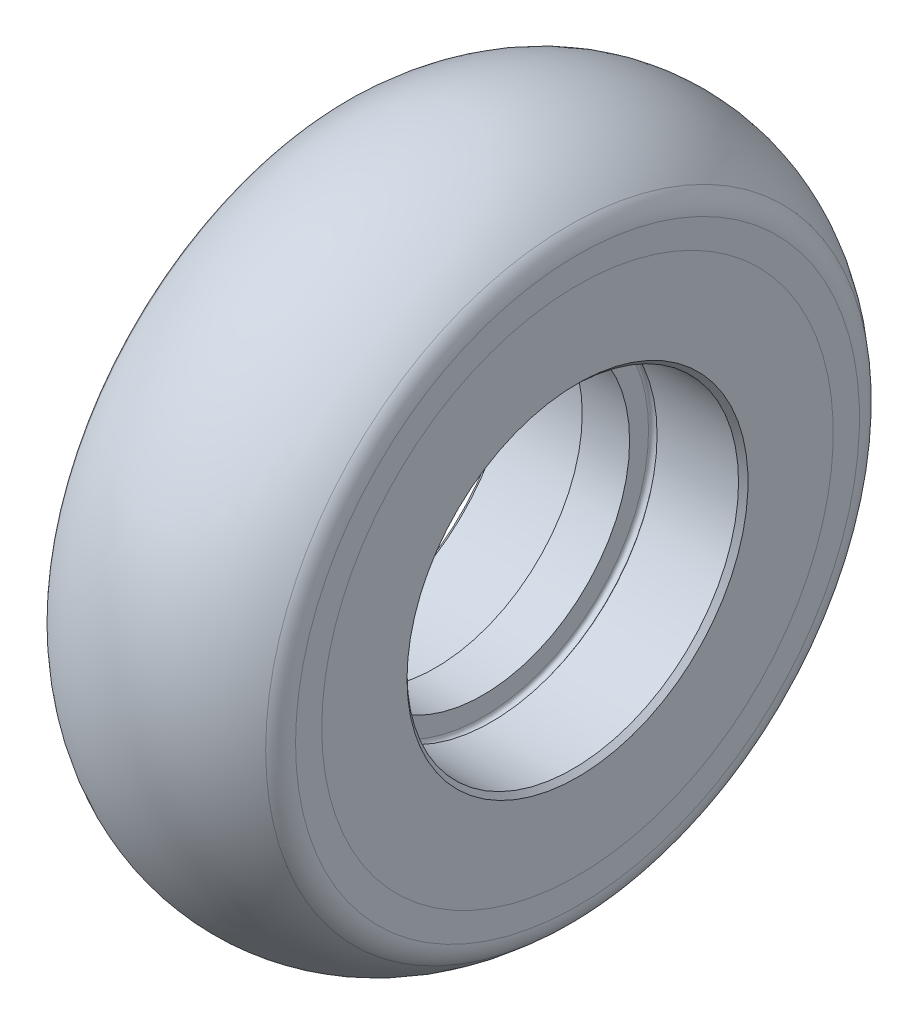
ISO-10303-21;
HEADER;
FILE_DESCRIPTION(('STEP AP214'),'2;1');
FILE_NAME('part.step','',(''),(''),'','','');
FILE_SCHEMA(('AUTOMOTIVE_DESIGN { 1 0 10303 214 1 1 1 1 }'));
ENDSEC;
DATA;
#1=APPLICATION_CONTEXT('core data for automotive mechanical design processes');
#2=APPLICATION_PROTOCOL_DEFINITION('international standard','automotive_design',2000,#1);
#3=PRODUCT_CONTEXT('',#1,'mechanical');
#4=PRODUCT('Part','Part','',(#3));
#5=PRODUCT_RELATED_PRODUCT_CATEGORY('part','',(#4));
#6=PRODUCT_DEFINITION_FORMATION('','',#4);
#7=PRODUCT_DEFINITION_CONTEXT('part definition',#1,'design');
#8=PRODUCT_DEFINITION('design','',#6,#7);
#9=PRODUCT_DEFINITION_SHAPE('','',#8);
#10=(LENGTH_UNIT() NAMED_UNIT(*) SI_UNIT(.MILLI.,.METRE.));
#11=(NAMED_UNIT(*) PLANE_ANGLE_UNIT() SI_UNIT($,.RADIAN.));
#12=(NAMED_UNIT(*) SI_UNIT($,.STERADIAN.) SOLID_ANGLE_UNIT());
#13=UNCERTAINTY_MEASURE_WITH_UNIT(LENGTH_MEASURE(1.E-05),#10,'distance_accuracy_value','');
#14=(GEOMETRIC_REPRESENTATION_CONTEXT(3) GLOBAL_UNCERTAINTY_ASSIGNED_CONTEXT((#13)) GLOBAL_UNIT_ASSIGNED_CONTEXT((#10,
#11,#12)) REPRESENTATION_CONTEXT('',''));
#15=CARTESIAN_POINT('',(0.,0.,0.));
#16=DIRECTION('',(0.,0.,1.));
#17=DIRECTION('',(1.,0.,0.));
#18=AXIS2_PLACEMENT_3D('',#15,#16,#17);
#19=CARTESIAN_POINT('',(-16.4076040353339,0.,0.));
#20=DIRECTION('',(-1.,0.,0.));
#21=DIRECTION('',(0.,0.,1.));
#22=AXIS2_PLACEMENT_3D('',#19,#20,#21);
#23=CYLINDRICAL_SURFACE('',#22,27.4999999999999);
#24=CARTESIAN_POINT('',(-8.43674989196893,0.,0.));
#25=DIRECTION('',(-1.,0.,0.));
#26=DIRECTION('',(0.,0.,1.));
#27=AXIS2_PLACEMENT_3D('',#24,#25,#26);
#28=CIRCLE('',#27,27.4999999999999);
#29=CARTESIAN_POINT('',(-8.43674989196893,0.,27.4999999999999));
#30=VERTEX_POINT('',#29);
#31=EDGE_CURVE('E11',#30,#30,#28,.T.);
#32=ORIENTED_EDGE('',*,*,#31,.F.);
#33=EDGE_LOOP('',(#32));
#34=FACE_BOUND('',#33,.T.);
#35=CARTESIAN_POINT('',(-11.9999999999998,0.,0.));
#36=DIRECTION('',(-1.,0.,0.));
#37=DIRECTION('',(0.,0.,1.));
#38=AXIS2_PLACEMENT_3D('',#35,#36,#37);
#39=CIRCLE('',#38,27.4999999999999);
#40=CARTESIAN_POINT('',(-11.9999999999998,0.,27.4999999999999));
#41=VERTEX_POINT('',#40);
#42=EDGE_CURVE('E97',#41,#41,#39,.T.);
#43=ORIENTED_EDGE('',*,*,#42,.T.);
#44=EDGE_LOOP('',(#43));
#45=FACE_BOUND('',#44,.T.);
#46=ADVANCED_FACE('F45',(#34,#45),#23,.F.);
#47=CARTESIAN_POINT('',(-8.43674989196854,0.,0.));
#48=DIRECTION('',(-1.,0.,0.));
#49=DIRECTION('',(0.,0.,1.));
#50=AXIS2_PLACEMENT_3D('',#47,#48,#49);
#51=TOROIDAL_SURFACE('',#50,29.4999999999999,2.);
#52=CARTESIAN_POINT('',(-6.90030733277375,0.,0.));
#53=DIRECTION('',(-1.,0.,0.));
#54=DIRECTION('',(0.,0.,1.));
#55=AXIS2_PLACEMENT_3D('',#52,#53,#54);
#56=CIRCLE('',#55,28.219631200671);
#57=CARTESIAN_POINT('',(-6.90030733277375,0.,28.219631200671));
#58=VERTEX_POINT('',#57);
#59=EDGE_CURVE('E51',#58,#58,#56,.T.);
#60=ORIENTED_EDGE('',*,*,#59,.F.);
#61=EDGE_LOOP('',(#60));
#62=FACE_BOUND('',#61,.T.);
#63=ORIENTED_EDGE('',*,*,#31,.T.);
#64=EDGE_LOOP('',(#63));
#65=FACE_BOUND('',#64,.T.);
#66=ADVANCED_FACE('F182',(#62,#65),#51,.T.);
#67=CARTESIAN_POINT('',(-6.90030733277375,0.,0.));
#68=DIRECTION('',(1.,0.,0.));
#69=DIRECTION('',(0.,0.,-1.));
#70=AXIS2_PLACEMENT_3D('',#67,#68,#69);
#71=CONICAL_SURFACE('',#70,28.219631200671,0.876058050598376);
#72=CARTESIAN_POINT('',(-5.59969266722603,0.,0.));
#73=DIRECTION('',(-1.,0.,0.));
#74=DIRECTION('',(0.,0.,1.));
#75=AXIS2_PLACEMENT_3D('',#72,#73,#74);
#76=CIRCLE('',#75,29.7803687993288);
#77=CARTESIAN_POINT('',(-5.59969266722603,0.,29.7803687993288));
#78=VERTEX_POINT('',#77);
#79=EDGE_CURVE('E55',#78,#78,#76,.T.);
#80=ORIENTED_EDGE('',*,*,#79,.F.);
#81=EDGE_LOOP('',(#80));
#82=FACE_BOUND('',#81,.T.);
#83=ORIENTED_EDGE('',*,*,#59,.T.);
#84=EDGE_LOOP('',(#83));
#85=FACE_BOUND('',#84,.T.);
#86=ADVANCED_FACE('F177',(#82,#85),#71,.F.);
#87=CARTESIAN_POINT('',(-4.06325010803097,0.,0.));
#88=DIRECTION('',(-1.,0.,0.));
#89=DIRECTION('',(0.,0.,1.));
#90=AXIS2_PLACEMENT_3D('',#87,#88,#89);
#91=TOROIDAL_SURFACE('',#90,28.5000000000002,2.);
#92=CARTESIAN_POINT('',(-4.06325010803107,0.,0.));
#93=DIRECTION('',(-1.,0.,0.));
#94=DIRECTION('',(0.,0.,1.));
#95=AXIS2_PLACEMENT_3D('',#92,#93,#94);
#96=CIRCLE('',#95,30.5000000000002);
#97=CARTESIAN_POINT('',(-4.06325010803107,0.,30.5000000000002));
#98=VERTEX_POINT('',#97);
#99=EDGE_CURVE('E59',#98,#98,#96,.T.);
#100=ORIENTED_EDGE('',*,*,#99,.F.);
#101=EDGE_LOOP('',(#100));
#102=FACE_BOUND('',#101,.T.);
#103=ORIENTED_EDGE('',*,*,#79,.T.);
#104=EDGE_LOOP('',(#103));
#105=FACE_BOUND('',#104,.T.);
#106=ADVANCED_FACE('F171',(#102,#105),#91,.F.);
#107=CARTESIAN_POINT('',(-16.4076040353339,0.,0.));
#108=DIRECTION('',(-1.,0.,0.));
#109=DIRECTION('',(0.,0.,1.));
#110=AXIS2_PLACEMENT_3D('',#107,#108,#109);
#111=CYLINDRICAL_SURFACE('',#110,30.5000000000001);
#112=CARTESIAN_POINT('',(4.06325010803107,0.,0.));
#113=DIRECTION('',(-1.,0.,0.));
#114=DIRECTION('',(0.,0.,1.));
#115=AXIS2_PLACEMENT_3D('',#112,#113,#114);
#116=CIRCLE('',#115,30.4999999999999);
#117=CARTESIAN_POINT('',(4.06325010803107,0.,30.4999999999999));
#118=VERTEX_POINT('',#117);
#119=EDGE_CURVE('E64',#118,#118,#116,.T.);
#120=ORIENTED_EDGE('',*,*,#119,.F.);
#121=EDGE_LOOP('',(#120));
#122=FACE_BOUND('',#121,.T.);
#123=ORIENTED_EDGE('',*,*,#99,.T.);
#124=EDGE_LOOP('',(#123));
#125=FACE_BOUND('',#124,.T.);
#126=ADVANCED_FACE('F165',(#122,#125),#111,.F.);
#127=CARTESIAN_POINT('',(4.06325010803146,0.,0.));
#128=DIRECTION('',(-1.,0.,0.));
#129=DIRECTION('',(0.,0.,1.));
#130=AXIS2_PLACEMENT_3D('',#127,#128,#129);
#131=TOROIDAL_SURFACE('',#130,28.4999999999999,2.);
#132=CARTESIAN_POINT('',(5.59969266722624,0.,0.));
#133=DIRECTION('',(-1.,0.,0.));
#134=DIRECTION('',(0.,0.,1.));
#135=AXIS2_PLACEMENT_3D('',#132,#133,#134);
#136=CIRCLE('',#135,29.7803687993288);
#137=CARTESIAN_POINT('',(5.59969266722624,0.,29.7803687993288));
#138=VERTEX_POINT('',#137);
#139=EDGE_CURVE('E67',#138,#138,#136,.T.);
#140=ORIENTED_EDGE('',*,*,#139,.F.);
#141=EDGE_LOOP('',(#140));
#142=FACE_BOUND('',#141,.T.);
#143=ORIENTED_EDGE('',*,*,#119,.T.);
#144=EDGE_LOOP('',(#143));
#145=FACE_BOUND('',#144,.T.);
#146=ADVANCED_FACE('F159',(#142,#145),#131,.F.);
#147=CARTESIAN_POINT('',(5.59969266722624,0.,0.));
#148=DIRECTION('',(-1.,0.,0.));
#149=DIRECTION('',(0.,0.,1.));
#150=AXIS2_PLACEMENT_3D('',#147,#148,#149);
#151=CONICAL_SURFACE('',#150,29.7803687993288,0.876058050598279);
#152=CARTESIAN_POINT('',(6.90030733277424,0.,0.));
#153=DIRECTION('',(-1.,0.,0.));
#154=DIRECTION('',(0.,0.,1.));
#155=AXIS2_PLACEMENT_3D('',#152,#153,#154);
#156=CIRCLE('',#155,28.2196312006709);
#157=CARTESIAN_POINT('',(6.90030733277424,0.,28.2196312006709));
#158=VERTEX_POINT('',#157);
#159=EDGE_CURVE('E70',#158,#158,#156,.T.);
#160=ORIENTED_EDGE('',*,*,#159,.F.);
#161=EDGE_LOOP('',(#160));
#162=FACE_BOUND('',#161,.T.);
#163=ORIENTED_EDGE('',*,*,#139,.T.);
#164=EDGE_LOOP('',(#163));
#165=FACE_BOUND('',#164,.T.);
#166=ADVANCED_FACE('F153',(#162,#165),#151,.F.);
#167=CARTESIAN_POINT('',(8.436749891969,0.,0.));
#168=DIRECTION('',(-1.,0.,0.));
#169=DIRECTION('',(0.,0.,1.));
#170=AXIS2_PLACEMENT_3D('',#167,#168,#169);
#171=TOROIDAL_SURFACE('',#170,29.4999999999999,2.);
#172=CARTESIAN_POINT('',(8.43674989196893,0.,0.));
#173=DIRECTION('',(-1.,0.,0.));
#174=DIRECTION('',(0.,0.,1.));
#175=AXIS2_PLACEMENT_3D('',#172,#173,#174);
#176=CIRCLE('',#175,27.4999999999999);
#177=CARTESIAN_POINT('',(8.43674989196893,0.,27.4999999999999));
#178=VERTEX_POINT('',#177);
#179=EDGE_CURVE('E73',#178,#178,#176,.T.);
#180=ORIENTED_EDGE('',*,*,#179,.F.);
#181=EDGE_LOOP('',(#180));
#182=FACE_BOUND('',#181,.T.);
#183=ORIENTED_EDGE('',*,*,#159,.T.);
#184=EDGE_LOOP('',(#183));
#185=FACE_BOUND('',#184,.T.);
#186=ADVANCED_FACE('F147',(#182,#185),#171,.T.);
#187=CARTESIAN_POINT('',(-16.4076040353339,0.,0.));
#188=DIRECTION('',(-1.,0.,0.));
#189=DIRECTION('',(0.,0.,1.));
#190=AXIS2_PLACEMENT_3D('',#187,#188,#189);
#191=CYLINDRICAL_SURFACE('',#190,27.4999999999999);
#192=CARTESIAN_POINT('',(11.9999999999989,0.,0.));
#193=DIRECTION('',(-1.,0.,0.));
#194=DIRECTION('',(0.,0.,1.));
#195=AXIS2_PLACEMENT_3D('',#192,#193,#194);
#196=CIRCLE('',#195,27.5);
#197=CARTESIAN_POINT('',(11.9999999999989,0.,27.5));
#198=VERTEX_POINT('',#197);
#199=EDGE_CURVE('E76',#198,#198,#196,.T.);
#200=ORIENTED_EDGE('',*,*,#199,.F.);
#201=EDGE_LOOP('',(#200));
#202=FACE_BOUND('',#201,.T.);
#203=ORIENTED_EDGE('',*,*,#179,.T.);
#204=EDGE_LOOP('',(#203));
#205=FACE_BOUND('',#204,.T.);
#206=ADVANCED_FACE('F141',(#202,#205),#191,.F.);
#207=CARTESIAN_POINT('',(11.9999999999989,0.,0.));
#208=DIRECTION('',(-1.,0.,0.));
#209=DIRECTION('',(0.,0.,1.));
#210=AXIS2_PLACEMENT_3D('',#207,#208,#209);
#211=CONICAL_SURFACE('',#210,27.5,0.785398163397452);
#212=CARTESIAN_POINT('',(12.4999999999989,0.,0.));
#213=DIRECTION('',(-1.,0.,0.));
#214=DIRECTION('',(0.,0.,1.));
#215=AXIS2_PLACEMENT_3D('',#212,#213,#214);
#216=CIRCLE('',#215,27.);
#217=CARTESIAN_POINT('',(12.4999999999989,0.,27.));
#218=VERTEX_POINT('',#217);
#219=EDGE_CURVE('E79',#218,#218,#216,.T.);
#220=ORIENTED_EDGE('',*,*,#219,.F.);
#221=EDGE_LOOP('',(#220));
#222=FACE_BOUND('',#221,.T.);
#223=ORIENTED_EDGE('',*,*,#199,.T.);
#224=EDGE_LOOP('',(#223));
#225=FACE_BOUND('',#224,.T.);
#226=ADVANCED_FACE('F135',(#222,#225),#211,.F.);
#227=CARTESIAN_POINT('',(12.4999999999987,0.,-27.));
#228=DIRECTION('',(-1.,0.,0.));
#229=DIRECTION('',(0.,0.,1.));
#230=AXIS2_PLACEMENT_3D('',#227,#228,#229);
#231=PLANE('',#230);
#232=CARTESIAN_POINT('',(12.4999999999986,0.,0.));
#233=DIRECTION('',(-1.,0.,0.));
#234=DIRECTION('',(0.,0.,1.));
#235=AXIS2_PLACEMENT_3D('',#232,#233,#234);
#236=CIRCLE('',#235,29.7669680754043);
#237=CARTESIAN_POINT('',(12.4999999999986,0.,29.7669680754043));
#238=VERTEX_POINT('',#237);
#239=EDGE_CURVE('E82',#238,#238,#236,.T.);
#240=ORIENTED_EDGE('',*,*,#239,.F.);
#241=EDGE_LOOP('',(#240));
#242=FACE_BOUND('',#241,.T.);
#243=ORIENTED_EDGE('',*,*,#219,.T.);
#244=EDGE_LOOP('',(#243));
#245=FACE_BOUND('',#244,.T.);
#246=ADVANCED_FACE('F129',(#242,#245),#231,.F.);
#247=CARTESIAN_POINT('',(9.49999999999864,0.,0.));
#248=DIRECTION('',(-1.,0.,0.));
#249=DIRECTION('',(0.,0.,1.));
#250=AXIS2_PLACEMENT_3D('',#247,#248,#249);
#251=TOROIDAL_SURFACE('',#250,29.7669680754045,3.);
#252=CARTESIAN_POINT('',(11.5423452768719,0.,0.));
#253=DIRECTION('',(-1.,0.,0.));
#254=DIRECTION('',(0.,0.,1.));
#255=AXIS2_PLACEMENT_3D('',#252,#253,#254);
#256=CIRCLE('',#255,31.964427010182);
#257=CARTESIAN_POINT('',(11.5423452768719,0.,31.964427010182));
#258=VERTEX_POINT('',#257);
#259=EDGE_CURVE('E85',#258,#258,#256,.T.);
#260=ORIENTED_EDGE('',*,*,#259,.F.);
#261=EDGE_LOOP('',(#260));
#262=FACE_BOUND('',#261,.T.);
#263=ORIENTED_EDGE('',*,*,#239,.T.);
#264=EDGE_LOOP('',(#263));
#265=FACE_BOUND('',#264,.T.);
#266=ADVANCED_FACE('F123',(#262,#265),#251,.T.);
#267=CARTESIAN_POINT('',(-1.37280893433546E-12,0.,0.));
#268=DIRECTION('',(-1.,0.,0.));
#269=DIRECTION('',(0.,0.,1.));
#270=AXIS2_PLACEMENT_3D('',#267,#268,#269);
#271=TOROIDAL_SURFACE('',#270,19.5454545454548,16.9545454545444);
#272=CARTESIAN_POINT('',(-11.5423452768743,0.,0.));
#273=DIRECTION('',(-1.,0.,0.));
#274=DIRECTION('',(0.,0.,1.));
#275=AXIS2_PLACEMENT_3D('',#272,#273,#274);
#276=CIRCLE('',#275,31.9644270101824);
#277=CARTESIAN_POINT('',(-11.5423452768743,0.,31.9644270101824));
#278=VERTEX_POINT('',#277);
#279=EDGE_CURVE('E88',#278,#278,#276,.T.);
#280=ORIENTED_EDGE('',*,*,#279,.F.);
#281=EDGE_LOOP('',(#280));
#282=FACE_BOUND('',#281,.T.);
#283=ORIENTED_EDGE('',*,*,#259,.T.);
#284=EDGE_LOOP('',(#283));
#285=FACE_BOUND('',#284,.T.);
#286=ADVANCED_FACE('F117',(#282,#285),#271,.T.);
#287=CARTESIAN_POINT('',(-9.5,0.,0.));
#288=DIRECTION('',(-1.,0.,0.));
#289=DIRECTION('',(0.,0.,1.));
#290=AXIS2_PLACEMENT_3D('',#287,#288,#289);
#291=TOROIDAL_SURFACE('',#290,29.7669680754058,3.);
#292=CARTESIAN_POINT('',(-12.5,0.,0.));
#293=DIRECTION('',(-1.,0.,0.));
#294=DIRECTION('',(0.,0.,1.));
#295=AXIS2_PLACEMENT_3D('',#292,#293,#294);
#296=CIRCLE('',#295,29.7669680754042);
#297=CARTESIAN_POINT('',(-12.5,0.,29.7669680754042));
#298=VERTEX_POINT('',#297);
#299=EDGE_CURVE('E91',#298,#298,#296,.T.);
#300=ORIENTED_EDGE('',*,*,#299,.F.);
#301=EDGE_LOOP('',(#300));
#302=FACE_BOUND('',#301,.T.);
#303=ORIENTED_EDGE('',*,*,#279,.T.);
#304=EDGE_LOOP('',(#303));
#305=FACE_BOUND('',#304,.T.);
#306=ADVANCED_FACE('F111',(#302,#305),#291,.T.);
#307=CARTESIAN_POINT('',(-12.4999999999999,0.,-26.9999999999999));
#308=DIRECTION('',(1.,0.,0.));
#309=DIRECTION('',(0.,0.,-1.));
#310=AXIS2_PLACEMENT_3D('',#307,#308,#309);
#311=PLANE('',#310);
#312=CARTESIAN_POINT('',(-12.4999999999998,0.,0.));
#313=DIRECTION('',(-1.,0.,0.));
#314=DIRECTION('',(0.,0.,1.));
#315=AXIS2_PLACEMENT_3D('',#312,#313,#314);
#316=CIRCLE('',#315,26.9999999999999);
#317=CARTESIAN_POINT('',(-12.4999999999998,0.,26.9999999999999));
#318=VERTEX_POINT('',#317);
#319=EDGE_CURVE('E94',#318,#318,#316,.T.);
#320=ORIENTED_EDGE('',*,*,#319,.F.);
#321=EDGE_LOOP('',(#320));
#322=FACE_BOUND('',#321,.T.);
#323=ORIENTED_EDGE('',*,*,#299,.T.);
#324=EDGE_LOOP('',(#323));
#325=FACE_BOUND('',#324,.T.);
#326=ADVANCED_FACE('F105',(#322,#325),#311,.F.);
#327=CARTESIAN_POINT('',(-12.4999999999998,0.,0.));
#328=DIRECTION('',(1.,0.,0.));
#329=DIRECTION('',(0.,0.,-1.));
#330=AXIS2_PLACEMENT_3D('',#327,#328,#329);
#331=CONICAL_SURFACE('',#330,26.9999999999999,0.785398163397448);
#332=ORIENTED_EDGE('',*,*,#42,.F.);
#333=EDGE_LOOP('',(#332));
#334=FACE_BOUND('',#333,.T.);
#335=ORIENTED_EDGE('',*,*,#319,.T.);
#336=EDGE_LOOP('',(#335));
#337=FACE_BOUND('',#336,.T.);
#338=ADVANCED_FACE('F102',(#334,#337),#331,.F.);
#339=CLOSED_SHELL('',(#46,#66,#86,#106,#126,#146,#166,#186,#206,#226,#246,#266,#286,#306,#326,#338));
#340=MANIFOLD_SOLID_BREP('B2',#339);
#341=CARTESIAN_POINT('',(-11.9999999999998,0.,0.));
#342=DIRECTION('',(1.,0.,0.));
#343=DIRECTION('',(0.,0.,-1.));
#344=AXIS2_PLACEMENT_3D('',#341,#342,#343);
#345=CONICAL_SURFACE('',#344,27.4999999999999,0.785398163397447);
#346=CARTESIAN_POINT('',(-12.5,0.,0.));
#347=DIRECTION('',(-1.,0.,0.));
#348=DIRECTION('',(0.,0.,1.));
#349=AXIS2_PLACEMENT_3D('',#346,#347,#348);
#350=CIRCLE('',#349,26.9999999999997);
#351=CARTESIAN_POINT('',(-12.5,0.,26.9999999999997));
#352=VERTEX_POINT('',#351);
#353=EDGE_CURVE('E44',#352,#352,#350,.T.);
#354=ORIENTED_EDGE('',*,*,#353,.F.);
#355=EDGE_LOOP('',(#354));
#356=FACE_BOUND('',#355,.T.);
#357=CARTESIAN_POINT('',(-11.9999999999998,0.,0.));
#358=DIRECTION('',(-1.,0.,0.));
#359=DIRECTION('',(0.,0.,1.));
#360=AXIS2_PLACEMENT_3D('',#357,#358,#359);
#361=CIRCLE('',#360,27.4999999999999);
#362=CARTESIAN_POINT('',(-11.9999999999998,0.,27.4999999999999));
#363=VERTEX_POINT('',#362);
#364=EDGE_CURVE('E363',#363,#363,#361,.T.);
#365=ORIENTED_EDGE('',*,*,#364,.T.);
#366=EDGE_LOOP('',(#365));
#367=FACE_BOUND('',#366,.T.);
#368=ADVANCED_FACE('F287',(#356,#367),#345,.T.);
#369=CARTESIAN_POINT('',(-12.5,0.,-26.9999999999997));
#370=DIRECTION('',(1.,0.,0.));
#371=DIRECTION('',(0.,0.,-1.));
#372=AXIS2_PLACEMENT_3D('',#369,#370,#371);
#373=PLANE('',#372);
#374=CARTESIAN_POINT('',(-12.5,0.,0.));
#375=DIRECTION('',(-1.,0.,0.));
#376=DIRECTION('',(0.,0.,1.));
#377=AXIS2_PLACEMENT_3D('',#374,#375,#376);
#378=CIRCLE('',#377,18.0000000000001);
#379=CARTESIAN_POINT('',(-12.5,0.,18.0000000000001));
#380=VERTEX_POINT('',#379);
#381=EDGE_CURVE('E293',#380,#380,#378,.T.);
#382=ORIENTED_EDGE('',*,*,#381,.F.);
#383=EDGE_LOOP('',(#382));
#384=FACE_BOUND('',#383,.T.);
#385=ORIENTED_EDGE('',*,*,#353,.T.);
#386=EDGE_LOOP('',(#385));
#387=FACE_BOUND('',#386,.T.);
#388=ADVANCED_FACE('F496',(#384,#387),#373,.F.);
#389=CARTESIAN_POINT('',(-12.5,0.,0.));
#390=DIRECTION('',(-1.,0.,0.));
#391=DIRECTION('',(0.,0.,1.));
#392=AXIS2_PLACEMENT_3D('',#389,#390,#391);
#393=CONICAL_SURFACE('',#392,18.0000000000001,0.785398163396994);
#394=CARTESIAN_POINT('',(-11.9999999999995,0.,0.));
#395=DIRECTION('',(-1.,0.,0.));
#396=DIRECTION('',(0.,0.,1.));
#397=AXIS2_PLACEMENT_3D('',#394,#395,#396);
#398=CIRCLE('',#397,17.5000000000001);
#399=CARTESIAN_POINT('',(-11.9999999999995,0.,17.5000000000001));
#400=VERTEX_POINT('',#399);
#401=EDGE_CURVE('E297',#400,#400,#398,.T.);
#402=ORIENTED_EDGE('',*,*,#401,.F.);
#403=EDGE_LOOP('',(#402));
#404=FACE_BOUND('',#403,.T.);
#405=ORIENTED_EDGE('',*,*,#381,.T.);
#406=EDGE_LOOP('',(#405));
#407=FACE_BOUND('',#406,.T.);
#408=ADVANCED_FACE('F491',(#404,#407),#393,.F.);
#409=CARTESIAN_POINT('',(-16.4076040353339,0.,0.));
#410=DIRECTION('',(-1.,0.,0.));
#411=DIRECTION('',(0.,0.,1.));
#412=AXIS2_PLACEMENT_3D('',#409,#410,#411);
#413=CYLINDRICAL_SURFACE('',#412,17.5000000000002);
#414=CARTESIAN_POINT('',(-3.40121797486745,0.,0.));
#415=DIRECTION('',(-1.,0.,0.));
#416=DIRECTION('',(0.,0.,1.));
#417=AXIS2_PLACEMENT_3D('',#414,#415,#416);
#418=CIRCLE('',#417,17.5000000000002);
#419=CARTESIAN_POINT('',(-3.40121797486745,0.,17.5000000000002));
#420=VERTEX_POINT('',#419);
#421=EDGE_CURVE('E301',#420,#420,#418,.T.);
#422=ORIENTED_EDGE('',*,*,#421,.F.);
#423=EDGE_LOOP('',(#422));
#424=FACE_BOUND('',#423,.T.);
#425=ORIENTED_EDGE('',*,*,#401,.T.);
#426=EDGE_LOOP('',(#425));
#427=FACE_BOUND('',#426,.T.);
#428=ADVANCED_FACE('F485',(#424,#427),#413,.F.);
#429=CARTESIAN_POINT('',(-3.40121797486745,0.,0.));
#430=DIRECTION('',(1.,0.,0.));
#431=DIRECTION('',(0.,0.,-1.));
#432=AXIS2_PLACEMENT_3D('',#429,#430,#431);
#433=CONICAL_SURFACE('',#432,17.5000000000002,0.924062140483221);
#434=CARTESIAN_POINT('',(-3.21922239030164,0.,0.));
#435=DIRECTION('',(-1.,0.,0.));
#436=DIRECTION('',(0.,0.,1.));
#437=AXIS2_PLACEMENT_3D('',#434,#435,#436);
#438=CIRCLE('',#437,17.7410333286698);
#439=CARTESIAN_POINT('',(-3.21922239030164,0.,17.7410333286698));
#440=VERTEX_POINT('',#439);
#441=EDGE_CURVE('E306',#440,#440,#438,.T.);
#442=ORIENTED_EDGE('',*,*,#441,.F.);
#443=EDGE_LOOP('',(#442));
#444=FACE_BOUND('',#443,.T.);
#445=ORIENTED_EDGE('',*,*,#421,.T.);
#446=EDGE_LOOP('',(#445));
#447=FACE_BOUND('',#446,.T.);
#448=ADVANCED_FACE('F479',(#444,#447),#433,.F.);
#449=CARTESIAN_POINT('',(-2.89999999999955,0.,0.));
#450=DIRECTION('',(-1.,0.,0.));
#451=DIRECTION('',(0.,0.,1.));
#452=AXIS2_PLACEMENT_3D('',#449,#450,#451);
#453=TOROIDAL_SURFACE('',#452,17.4999999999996,0.399999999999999);
#454=CARTESIAN_POINT('',(-2.49999999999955,0.,0.));
#455=DIRECTION('',(-1.,0.,0.));
#456=DIRECTION('',(0.,0.,1.));
#457=AXIS2_PLACEMENT_3D('',#454,#455,#456);
#458=CIRCLE('',#457,17.5000000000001);
#459=CARTESIAN_POINT('',(-2.49999999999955,0.,17.5000000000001));
#460=VERTEX_POINT('',#459);
#461=EDGE_CURVE('E309',#460,#460,#458,.T.);
#462=ORIENTED_EDGE('',*,*,#461,.F.);
#463=EDGE_LOOP('',(#462));
#464=FACE_BOUND('',#463,.T.);
#465=ORIENTED_EDGE('',*,*,#441,.T.);
#466=EDGE_LOOP('',(#465));
#467=FACE_BOUND('',#466,.T.);
#468=ADVANCED_FACE('F473',(#464,#467),#453,.F.);
#469=CARTESIAN_POINT('',(-2.49999999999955,0.,-17.5000000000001));
#470=DIRECTION('',(1.,0.,0.));
#471=DIRECTION('',(0.,0.,-1.));
#472=AXIS2_PLACEMENT_3D('',#469,#470,#471);
#473=PLANE('',#472);
#474=CARTESIAN_POINT('',(-2.49999999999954,0.,0.));
#475=DIRECTION('',(-1.,0.,0.));
#476=DIRECTION('',(0.,0.,1.));
#477=AXIS2_PLACEMENT_3D('',#474,#475,#476);
#478=CIRCLE('',#477,15.5000000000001);
#479=CARTESIAN_POINT('',(-2.49999999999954,0.,15.5000000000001));
#480=VERTEX_POINT('',#479);
#481=EDGE_CURVE('E312',#480,#480,#478,.T.);
#482=ORIENTED_EDGE('',*,*,#481,.F.);
#483=EDGE_LOOP('',(#482));
#484=FACE_BOUND('',#483,.T.);
#485=ORIENTED_EDGE('',*,*,#461,.T.);
#486=EDGE_LOOP('',(#485));
#487=FACE_BOUND('',#486,.T.);
#488=ADVANCED_FACE('F467',(#484,#487),#473,.F.);
#489=CARTESIAN_POINT('',(-16.4076040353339,0.,0.));
#490=DIRECTION('',(-1.,0.,0.));
#491=DIRECTION('',(0.,0.,1.));
#492=AXIS2_PLACEMENT_3D('',#489,#490,#491);
#493=CYLINDRICAL_SURFACE('',#492,15.5000000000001);
#494=CARTESIAN_POINT('',(2.49999999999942,0.,0.));
#495=DIRECTION('',(-1.,0.,0.));
#496=DIRECTION('',(0.,0.,1.));
#497=AXIS2_PLACEMENT_3D('',#494,#495,#496);
#498=CIRCLE('',#497,15.5000000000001);
#499=CARTESIAN_POINT('',(2.49999999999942,0.,15.5000000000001));
#500=VERTEX_POINT('',#499);
#501=EDGE_CURVE('E315',#500,#500,#498,.T.);
#502=ORIENTED_EDGE('',*,*,#501,.F.);
#503=EDGE_LOOP('',(#502));
#504=FACE_BOUND('',#503,.T.);
#505=ORIENTED_EDGE('',*,*,#481,.T.);
#506=EDGE_LOOP('',(#505));
#507=FACE_BOUND('',#506,.T.);
#508=ADVANCED_FACE('F461',(#504,#507),#493,.F.);
#509=CARTESIAN_POINT('',(2.49999999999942,0.,-17.5000000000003));
#510=DIRECTION('',(-1.,0.,0.));
#511=DIRECTION('',(0.,0.,1.));
#512=AXIS2_PLACEMENT_3D('',#509,#510,#511);
#513=PLANE('',#512);
#514=CARTESIAN_POINT('',(2.49999999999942,0.,0.));
#515=DIRECTION('',(-1.,0.,0.));
#516=DIRECTION('',(0.,0.,1.));
#517=AXIS2_PLACEMENT_3D('',#514,#515,#516);
#518=CIRCLE('',#517,17.5000000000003);
#519=CARTESIAN_POINT('',(2.49999999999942,0.,17.5000000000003));
#520=VERTEX_POINT('',#519);
#521=EDGE_CURVE('E318',#520,#520,#518,.T.);
#522=ORIENTED_EDGE('',*,*,#521,.F.);
#523=EDGE_LOOP('',(#522));
#524=FACE_BOUND('',#523,.T.);
#525=ORIENTED_EDGE('',*,*,#501,.T.);
#526=EDGE_LOOP('',(#525));
#527=FACE_BOUND('',#526,.T.);
#528=ADVANCED_FACE('F455',(#524,#527),#513,.F.);
#529=CARTESIAN_POINT('',(2.89999999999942,0.,0.));
#530=DIRECTION('',(-1.,0.,0.));
#531=DIRECTION('',(0.,0.,1.));
#532=AXIS2_PLACEMENT_3D('',#529,#530,#531);
#533=TOROIDAL_SURFACE('',#532,17.5000000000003,0.4);
#534=CARTESIAN_POINT('',(3.21922239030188,0.,0.));
#535=DIRECTION('',(-1.,0.,0.));
#536=DIRECTION('',(0.,0.,1.));
#537=AXIS2_PLACEMENT_3D('',#534,#535,#536);
#538=CIRCLE('',#537,17.74103332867);
#539=CARTESIAN_POINT('',(3.21922239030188,0.,17.74103332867));
#540=VERTEX_POINT('',#539);
#541=EDGE_CURVE('E321',#540,#540,#538,.T.);
#542=ORIENTED_EDGE('',*,*,#541,.F.);
#543=EDGE_LOOP('',(#542));
#544=FACE_BOUND('',#543,.T.);
#545=ORIENTED_EDGE('',*,*,#521,.T.);
#546=EDGE_LOOP('',(#545));
#547=FACE_BOUND('',#546,.T.);
#548=ADVANCED_FACE('F449',(#544,#547),#533,.F.);
#549=CARTESIAN_POINT('',(3.21922239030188,0.,0.));
#550=DIRECTION('',(-1.,0.,0.));
#551=DIRECTION('',(0.,0.,1.));
#552=AXIS2_PLACEMENT_3D('',#549,#550,#551);
#553=CONICAL_SURFACE('',#552,17.74103332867,0.924062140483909);
#554=CARTESIAN_POINT('',(3.40121797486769,0.,0.));
#555=DIRECTION('',(-1.,0.,0.));
#556=DIRECTION('',(0.,0.,1.));
#557=AXIS2_PLACEMENT_3D('',#554,#555,#556);
#558=CIRCLE('',#557,17.5000000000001);
#559=CARTESIAN_POINT('',(3.40121797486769,0.,17.5000000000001));
#560=VERTEX_POINT('',#559);
#561=EDGE_CURVE('E324',#560,#560,#558,.T.);
#562=ORIENTED_EDGE('',*,*,#561,.F.);
#563=EDGE_LOOP('',(#562));
#564=FACE_BOUND('',#563,.T.);
#565=ORIENTED_EDGE('',*,*,#541,.T.);
#566=EDGE_LOOP('',(#565));
#567=FACE_BOUND('',#566,.T.);
#568=ADVANCED_FACE('F443',(#564,#567),#553,.F.);
#569=CARTESIAN_POINT('',(-16.4076040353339,0.,0.));
#570=DIRECTION('',(-1.,0.,0.));
#571=DIRECTION('',(0.,0.,1.));
#572=AXIS2_PLACEMENT_3D('',#569,#570,#571);
#573=CYLINDRICAL_SURFACE('',#572,17.5000000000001);
#574=CARTESIAN_POINT('',(11.9999999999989,0.,0.));
#575=DIRECTION('',(-1.,0.,0.));
#576=DIRECTION('',(0.,0.,1.));
#577=AXIS2_PLACEMENT_3D('',#574,#575,#576);
#578=CIRCLE('',#577,17.5000000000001);
#579=CARTESIAN_POINT('',(11.9999999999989,0.,17.5000000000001));
#580=VERTEX_POINT('',#579);
#581=EDGE_CURVE('E327',#580,#580,#578,.T.);
#582=ORIENTED_EDGE('',*,*,#581,.F.);
#583=EDGE_LOOP('',(#582));
#584=FACE_BOUND('',#583,.T.);
#585=ORIENTED_EDGE('',*,*,#561,.T.);
#586=EDGE_LOOP('',(#585));
#587=FACE_BOUND('',#586,.T.);
#588=ADVANCED_FACE('F437',(#584,#587),#573,.F.);
#589=CARTESIAN_POINT('',(11.9999999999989,0.,0.));
#590=DIRECTION('',(1.,0.,0.));
#591=DIRECTION('',(0.,0.,-1.));
#592=AXIS2_PLACEMENT_3D('',#589,#590,#591);
#593=CONICAL_SURFACE('',#592,17.5000000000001,0.785398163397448);
#594=CARTESIAN_POINT('',(12.4999999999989,0.,0.));
#595=DIRECTION('',(-1.,0.,0.));
#596=DIRECTION('',(0.,0.,1.));
#597=AXIS2_PLACEMENT_3D('',#594,#595,#596);
#598=CIRCLE('',#597,18.0000000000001);
#599=CARTESIAN_POINT('',(12.4999999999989,0.,18.0000000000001));
#600=VERTEX_POINT('',#599);
#601=EDGE_CURVE('E330',#600,#600,#598,.T.);
#602=ORIENTED_EDGE('',*,*,#601,.F.);
#603=EDGE_LOOP('',(#602));
#604=FACE_BOUND('',#603,.T.);
#605=ORIENTED_EDGE('',*,*,#581,.T.);
#606=EDGE_LOOP('',(#605));
#607=FACE_BOUND('',#606,.T.);
#608=ADVANCED_FACE('F431',(#604,#607),#593,.F.);
#609=CARTESIAN_POINT('',(12.4999999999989,0.,-18.0000000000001));
#610=DIRECTION('',(-1.,0.,0.));
#611=DIRECTION('',(0.,0.,1.));
#612=AXIS2_PLACEMENT_3D('',#609,#610,#611);
#613=PLANE('',#612);
#614=CARTESIAN_POINT('',(12.4999999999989,0.,0.));
#615=DIRECTION('',(-1.,0.,0.));
#616=DIRECTION('',(0.,0.,1.));
#617=AXIS2_PLACEMENT_3D('',#614,#615,#616);
#618=CIRCLE('',#617,27.);
#619=CARTESIAN_POINT('',(12.4999999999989,0.,27.));
#620=VERTEX_POINT('',#619);
#621=EDGE_CURVE('E333',#620,#620,#618,.T.);
#622=ORIENTED_EDGE('',*,*,#621,.F.);
#623=EDGE_LOOP('',(#622));
#624=FACE_BOUND('',#623,.T.);
#625=ORIENTED_EDGE('',*,*,#601,.T.);
#626=EDGE_LOOP('',(#625));
#627=FACE_BOUND('',#626,.T.);
#628=ADVANCED_FACE('F425',(#624,#627),#613,.F.);
#629=CARTESIAN_POINT('',(12.4999999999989,0.,0.));
#630=DIRECTION('',(-1.,0.,0.));
#631=DIRECTION('',(0.,0.,1.));
#632=AXIS2_PLACEMENT_3D('',#629,#630,#631);
#633=CONICAL_SURFACE('',#632,27.,0.785398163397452);
#634=CARTESIAN_POINT('',(11.9999999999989,0.,0.));
#635=DIRECTION('',(-1.,0.,0.));
#636=DIRECTION('',(0.,0.,1.));
#637=AXIS2_PLACEMENT_3D('',#634,#635,#636);
#638=CIRCLE('',#637,27.5);
#639=CARTESIAN_POINT('',(11.9999999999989,0.,27.5));
#640=VERTEX_POINT('',#639);
#641=EDGE_CURVE('E336',#640,#640,#638,.T.);
#642=ORIENTED_EDGE('',*,*,#641,.F.);
#643=EDGE_LOOP('',(#642));
#644=FACE_BOUND('',#643,.T.);
#645=ORIENTED_EDGE('',*,*,#621,.T.);
#646=EDGE_LOOP('',(#645));
#647=FACE_BOUND('',#646,.T.);
#648=ADVANCED_FACE('F419',(#644,#647),#633,.T.);
#649=CARTESIAN_POINT('',(-16.4076040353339,0.,0.));
#650=DIRECTION('',(-1.,0.,0.));
#651=DIRECTION('',(0.,0.,1.));
#652=AXIS2_PLACEMENT_3D('',#649,#650,#651);
#653=CYLINDRICAL_SURFACE('',#652,27.4999999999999);
#654=CARTESIAN_POINT('',(8.43674989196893,0.,0.));
#655=DIRECTION('',(-1.,0.,0.));
#656=DIRECTION('',(0.,0.,1.));
#657=AXIS2_PLACEMENT_3D('',#654,#655,#656);
#658=CIRCLE('',#657,27.4999999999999);
#659=CARTESIAN_POINT('',(8.43674989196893,0.,27.4999999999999));
#660=VERTEX_POINT('',#659);
#661=EDGE_CURVE('E339',#660,#660,#658,.T.);
#662=ORIENTED_EDGE('',*,*,#661,.F.);
#663=EDGE_LOOP('',(#662));
#664=FACE_BOUND('',#663,.T.);
#665=ORIENTED_EDGE('',*,*,#641,.T.);
#666=EDGE_LOOP('',(#665));
#667=FACE_BOUND('',#666,.T.);
#668=ADVANCED_FACE('F413',(#664,#667),#653,.T.);
#669=CARTESIAN_POINT('',(8.436749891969,0.,0.));
#670=DIRECTION('',(-1.,0.,0.));
#671=DIRECTION('',(0.,0.,1.));
#672=AXIS2_PLACEMENT_3D('',#669,#670,#671);
#673=TOROIDAL_SURFACE('',#672,29.4999999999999,2.);
#674=CARTESIAN_POINT('',(6.90030733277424,0.,0.));
#675=DIRECTION('',(-1.,0.,0.));
#676=DIRECTION('',(0.,0.,1.));
#677=AXIS2_PLACEMENT_3D('',#674,#675,#676);
#678=CIRCLE('',#677,28.2196312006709);
#679=CARTESIAN_POINT('',(6.90030733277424,0.,28.2196312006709));
#680=VERTEX_POINT('',#679);
#681=EDGE_CURVE('E342',#680,#680,#678,.T.);
#682=ORIENTED_EDGE('',*,*,#681,.F.);
#683=EDGE_LOOP('',(#682));
#684=FACE_BOUND('',#683,.T.);
#685=ORIENTED_EDGE('',*,*,#661,.T.);
#686=EDGE_LOOP('',(#685));
#687=FACE_BOUND('',#686,.T.);
#688=ADVANCED_FACE('F407',(#684,#687),#673,.F.);
#689=CARTESIAN_POINT('',(6.90030733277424,0.,0.));
#690=DIRECTION('',(-1.,0.,0.));
#691=DIRECTION('',(0.,0.,1.));
#692=AXIS2_PLACEMENT_3D('',#689,#690,#691);
#693=CONICAL_SURFACE('',#692,28.2196312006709,0.876058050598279);
#694=CARTESIAN_POINT('',(5.59969266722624,0.,0.));
#695=DIRECTION('',(-1.,0.,0.));
#696=DIRECTION('',(0.,0.,1.));
#697=AXIS2_PLACEMENT_3D('',#694,#695,#696);
#698=CIRCLE('',#697,29.7803687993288);
#699=CARTESIAN_POINT('',(5.59969266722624,0.,29.7803687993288));
#700=VERTEX_POINT('',#699);
#701=EDGE_CURVE('E345',#700,#700,#698,.T.);
#702=ORIENTED_EDGE('',*,*,#701,.F.);
#703=EDGE_LOOP('',(#702));
#704=FACE_BOUND('',#703,.T.);
#705=ORIENTED_EDGE('',*,*,#681,.T.);
#706=EDGE_LOOP('',(#705));
#707=FACE_BOUND('',#706,.T.);
#708=ADVANCED_FACE('F401',(#704,#707),#693,.T.);
#709=CARTESIAN_POINT('',(4.06325010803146,0.,0.));
#710=DIRECTION('',(-1.,0.,0.));
#711=DIRECTION('',(0.,0.,1.));
#712=AXIS2_PLACEMENT_3D('',#709,#710,#711);
#713=TOROIDAL_SURFACE('',#712,28.4999999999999,2.);
#714=CARTESIAN_POINT('',(4.06325010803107,0.,0.));
#715=DIRECTION('',(-1.,0.,0.));
#716=DIRECTION('',(0.,0.,1.));
#717=AXIS2_PLACEMENT_3D('',#714,#715,#716);
#718=CIRCLE('',#717,30.4999999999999);
#719=CARTESIAN_POINT('',(4.06325010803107,0.,30.4999999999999));
#720=VERTEX_POINT('',#719);
#721=EDGE_CURVE('E348',#720,#720,#718,.T.);
#722=ORIENTED_EDGE('',*,*,#721,.F.);
#723=EDGE_LOOP('',(#722));
#724=FACE_BOUND('',#723,.T.);
#725=ORIENTED_EDGE('',*,*,#701,.T.);
#726=EDGE_LOOP('',(#725));
#727=FACE_BOUND('',#726,.T.);
#728=ADVANCED_FACE('F395',(#724,#727),#713,.T.);
#729=CARTESIAN_POINT('',(-16.4076040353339,0.,0.));
#730=DIRECTION('',(-1.,0.,0.));
#731=DIRECTION('',(0.,0.,1.));
#732=AXIS2_PLACEMENT_3D('',#729,#730,#731);
#733=CYLINDRICAL_SURFACE('',#732,30.5000000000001);
#734=CARTESIAN_POINT('',(-4.06325010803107,0.,0.));
#735=DIRECTION('',(-1.,0.,0.));
#736=DIRECTION('',(0.,0.,1.));
#737=AXIS2_PLACEMENT_3D('',#734,#735,#736);
#738=CIRCLE('',#737,30.5000000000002);
#739=CARTESIAN_POINT('',(-4.06325010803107,0.,30.5000000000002));
#740=VERTEX_POINT('',#739);
#741=EDGE_CURVE('E351',#740,#740,#738,.T.);
#742=ORIENTED_EDGE('',*,*,#741,.F.);
#743=EDGE_LOOP('',(#742));
#744=FACE_BOUND('',#743,.T.);
#745=ORIENTED_EDGE('',*,*,#721,.T.);
#746=EDGE_LOOP('',(#745));
#747=FACE_BOUND('',#746,.T.);
#748=ADVANCED_FACE('F389',(#744,#747),#733,.T.);
#749=CARTESIAN_POINT('',(-4.06325010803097,0.,0.));
#750=DIRECTION('',(-1.,0.,0.));
#751=DIRECTION('',(0.,0.,1.));
#752=AXIS2_PLACEMENT_3D('',#749,#750,#751);
#753=TOROIDAL_SURFACE('',#752,28.5000000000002,2.);
#754=CARTESIAN_POINT('',(-5.59969266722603,0.,0.));
#755=DIRECTION('',(-1.,0.,0.));
#756=DIRECTION('',(0.,0.,1.));
#757=AXIS2_PLACEMENT_3D('',#754,#755,#756);
#758=CIRCLE('',#757,29.7803687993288);
#759=CARTESIAN_POINT('',(-5.59969266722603,0.,29.7803687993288));
#760=VERTEX_POINT('',#759);
#761=EDGE_CURVE('E354',#760,#760,#758,.T.);
#762=ORIENTED_EDGE('',*,*,#761,.F.);
#763=EDGE_LOOP('',(#762));
#764=FACE_BOUND('',#763,.T.);
#765=ORIENTED_EDGE('',*,*,#741,.T.);
#766=EDGE_LOOP('',(#765));
#767=FACE_BOUND('',#766,.T.);
#768=ADVANCED_FACE('F383',(#764,#767),#753,.T.);
#769=CARTESIAN_POINT('',(-5.59969266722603,0.,0.));
#770=DIRECTION('',(1.,0.,0.));
#771=DIRECTION('',(0.,0.,-1.));
#772=AXIS2_PLACEMENT_3D('',#769,#770,#771);
#773=CONICAL_SURFACE('',#772,29.7803687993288,0.876058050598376);
#774=CARTESIAN_POINT('',(-6.90030733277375,0.,0.));
#775=DIRECTION('',(-1.,0.,0.));
#776=DIRECTION('',(0.,0.,1.));
#777=AXIS2_PLACEMENT_3D('',#774,#775,#776);
#778=CIRCLE('',#777,28.219631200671);
#779=CARTESIAN_POINT('',(-6.90030733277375,0.,28.219631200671));
#780=VERTEX_POINT('',#779);
#781=EDGE_CURVE('E357',#780,#780,#778,.T.);
#782=ORIENTED_EDGE('',*,*,#781,.F.);
#783=EDGE_LOOP('',(#782));
#784=FACE_BOUND('',#783,.T.);
#785=ORIENTED_EDGE('',*,*,#761,.T.);
#786=EDGE_LOOP('',(#785));
#787=FACE_BOUND('',#786,.T.);
#788=ADVANCED_FACE('F377',(#784,#787),#773,.T.);
#789=CARTESIAN_POINT('',(-8.43674989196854,0.,0.));
#790=DIRECTION('',(-1.,0.,0.));
#791=DIRECTION('',(0.,0.,1.));
#792=AXIS2_PLACEMENT_3D('',#789,#790,#791);
#793=TOROIDAL_SURFACE('',#792,29.4999999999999,2.);
#794=CARTESIAN_POINT('',(-8.43674989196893,0.,0.));
#795=DIRECTION('',(-1.,0.,0.));
#796=DIRECTION('',(0.,0.,1.));
#797=AXIS2_PLACEMENT_3D('',#794,#795,#796);
#798=CIRCLE('',#797,27.4999999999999);
#799=CARTESIAN_POINT('',(-8.43674989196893,0.,27.4999999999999));
#800=VERTEX_POINT('',#799);
#801=EDGE_CURVE('E360',#800,#800,#798,.T.);
#802=ORIENTED_EDGE('',*,*,#801,.F.);
#803=EDGE_LOOP('',(#802));
#804=FACE_BOUND('',#803,.T.);
#805=ORIENTED_EDGE('',*,*,#781,.T.);
#806=EDGE_LOOP('',(#805));
#807=FACE_BOUND('',#806,.T.);
#808=ADVANCED_FACE('F371',(#804,#807),#793,.F.);
#809=CARTESIAN_POINT('',(-16.4076040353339,0.,0.));
#810=DIRECTION('',(-1.,0.,0.));
#811=DIRECTION('',(0.,0.,1.));
#812=AXIS2_PLACEMENT_3D('',#809,#810,#811);
#813=CYLINDRICAL_SURFACE('',#812,27.4999999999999);
#814=ORIENTED_EDGE('',*,*,#364,.F.);
#815=EDGE_LOOP('',(#814));
#816=FACE_BOUND('',#815,.T.);
#817=ORIENTED_EDGE('',*,*,#801,.T.);
#818=EDGE_LOOP('',(#817));
#819=FACE_BOUND('',#818,.T.);
#820=ADVANCED_FACE('F368',(#816,#819),#813,.T.);
#821=CLOSED_SHELL('',(#368,#388,#408,#428,#448,#468,#488,#508,#528,#548,#568,#588,#608,#628,
#648,#668,#688,#708,#728,#748,#768,#788,#808,#820));
#822=MANIFOLD_SOLID_BREP('B6',#821);
#823=ADVANCED_BREP_SHAPE_REPRESENTATION('',(#18,#340,#822),#14);
#824=SHAPE_DEFINITION_REPRESENTATION(#9,#823);
ENDSEC;
END-ISO-10303-21;
